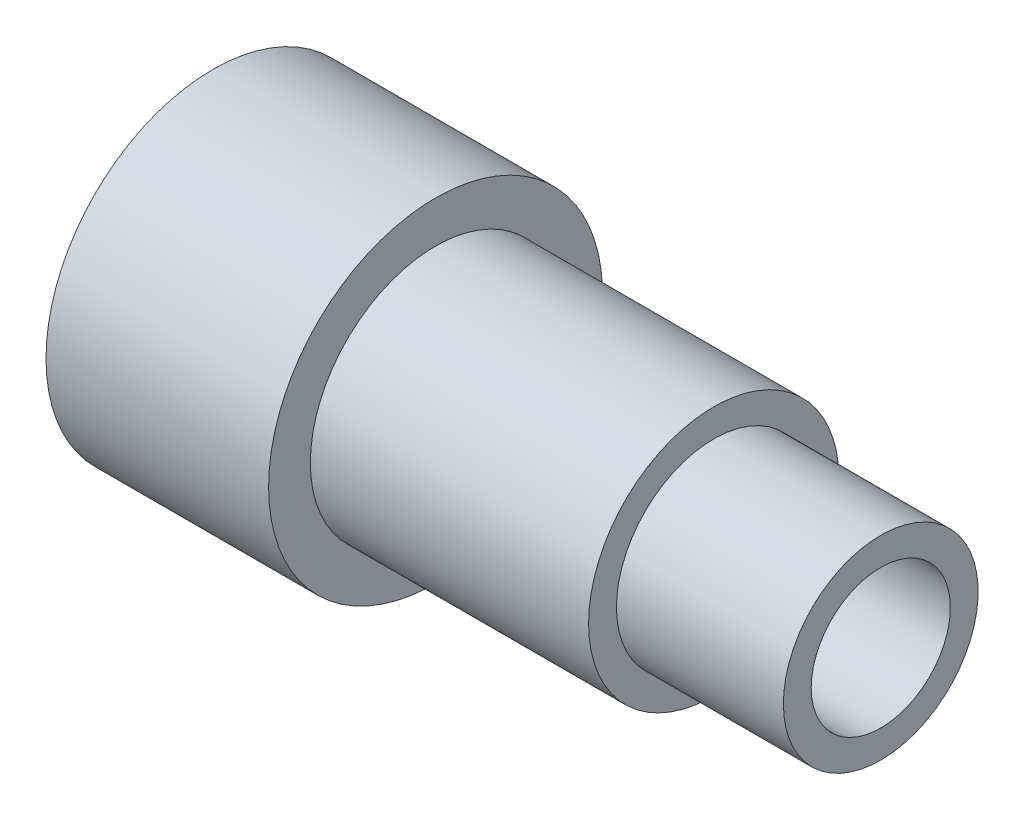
from build123d import *

# Parameters (mm, degrees)
SKETCH_2_R          = 3
CUT_EXTRUDE_1_DEPTH = 30
SKETCH_3_W          = 8
SKETCH_3_H          = 8
CUT_EXTRUDE_2_DEPTH = 130


with BuildPart() as part:
    # Sketch 1 → Revolve 1 (revolve)
    with BuildSketch(Plane.XY, mode=Mode.PRIVATE) as revolve_1_sk:
        Polygon((0, 12.5), (0, 30), (40, 30), (40, 22.5), (90, 22.5), (90, 17.5), (120, 17.5), (120, 12.5), align=None)
    revolve(revolve_1_sk.sketch.rotate(Axis((0, 0, 0), (1, 0, 0)), 90), axis=Axis((0, 0, 0), (1, 0, 0)))

    # Sketch 2 → Cut-Extrude 1 (cut)
    with BuildSketch(Plane(origin=(0, 0, 0), x_dir=(1, 0, 0), z_dir=(0, 1, 0))):
        with Locations(Location((65, 0, 0), (0, 0, 270))):
            Circle(SKETCH_2_R)
    extrude(amount=-CUT_EXTRUDE_1_DEPTH, mode=Mode.SUBTRACT)

    # Sketch 3 → Cut-Extrude 2 (cut)
    with BuildSketch(Plane.XY):
        with Locations((0, 13)):
            Rectangle(SKETCH_3_W, SKETCH_3_H)
    extrude(amount=-CUT_EXTRUDE_2_DEPTH, mode=Mode.SUBTRACT)


solid = part.part
